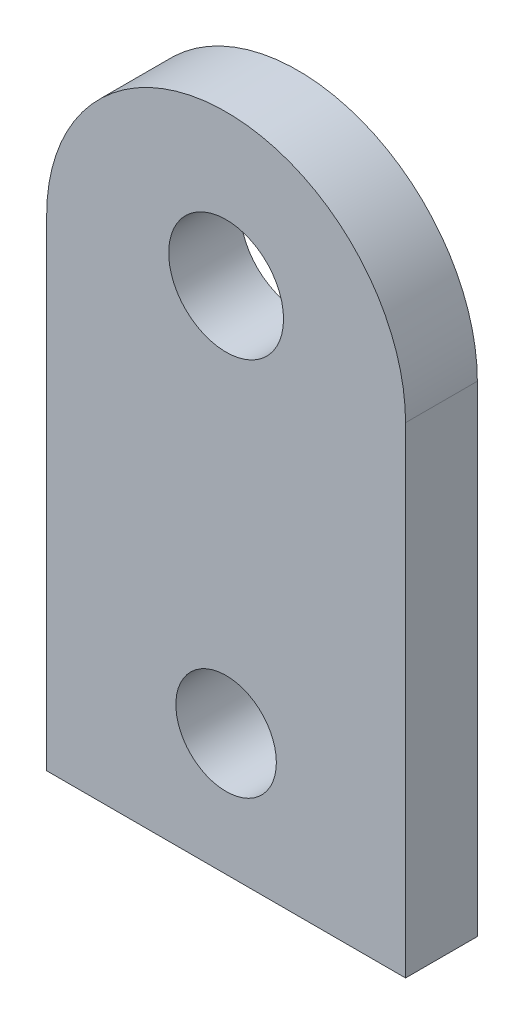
ISO-10303-21;
HEADER;
FILE_DESCRIPTION(('STEP AP214'),'2;1');
FILE_NAME('part.step','',(''),(''),'','','');
FILE_SCHEMA(('AUTOMOTIVE_DESIGN { 1 0 10303 214 1 1 1 1 }'));
ENDSEC;
DATA;
#1=APPLICATION_CONTEXT('core data for automotive mechanical design processes');
#2=APPLICATION_PROTOCOL_DEFINITION('international standard','automotive_design',2000,#1);
#3=PRODUCT_CONTEXT('',#1,'mechanical');
#4=PRODUCT('Part','Part','',(#3));
#5=PRODUCT_RELATED_PRODUCT_CATEGORY('part','',(#4));
#6=PRODUCT_DEFINITION_FORMATION('','',#4);
#7=PRODUCT_DEFINITION_CONTEXT('part definition',#1,'design');
#8=PRODUCT_DEFINITION('design','',#6,#7);
#9=PRODUCT_DEFINITION_SHAPE('','',#8);
#10=(LENGTH_UNIT() NAMED_UNIT(*) SI_UNIT(.MILLI.,.METRE.));
#11=(NAMED_UNIT(*) PLANE_ANGLE_UNIT() SI_UNIT($,.RADIAN.));
#12=(NAMED_UNIT(*) SI_UNIT($,.STERADIAN.) SOLID_ANGLE_UNIT());
#13=UNCERTAINTY_MEASURE_WITH_UNIT(LENGTH_MEASURE(1.E-05),#10,'distance_accuracy_value','');
#14=(GEOMETRIC_REPRESENTATION_CONTEXT(3) GLOBAL_UNCERTAINTY_ASSIGNED_CONTEXT((#13)) GLOBAL_UNIT_ASSIGNED_CONTEXT((#10,
#11,#12)) REPRESENTATION_CONTEXT('',''));
#15=CARTESIAN_POINT('',(0.,0.,0.));
#16=DIRECTION('',(0.,0.,1.));
#17=DIRECTION('',(1.,0.,0.));
#18=AXIS2_PLACEMENT_3D('',#15,#16,#17);
#19=CARTESIAN_POINT('',(-12.5,33.5,5.));
#20=DIRECTION('',(1.,0.,0.));
#21=DIRECTION('',(0.,1.,0.));
#22=AXIS2_PLACEMENT_3D('',#19,#20,#21);
#23=PLANE('',#22);
#24=DIRECTION('',(0.,-1.,0.));
#25=VECTOR('',#24,1.);
#26=CARTESIAN_POINT('',(-12.5,33.5,0.));
#27=LINE('',#26,#25);
#28=CARTESIAN_POINT('',(-12.5,33.5,0.));
#29=VERTEX_POINT('',#28);
#30=CARTESIAN_POINT('',(-12.5,0.,0.));
#31=VERTEX_POINT('',#30);
#32=EDGE_CURVE('E98',#29,#31,#27,.T.);
#33=ORIENTED_EDGE('',*,*,#32,.T.);
#34=DIRECTION('',(0.,0.,-1.));
#35=VECTOR('',#34,1.);
#36=CARTESIAN_POINT('',(-12.5,0.,5.));
#37=LINE('',#36,#35);
#38=CARTESIAN_POINT('',(-12.5,0.,5.));
#39=VERTEX_POINT('',#38);
#40=EDGE_CURVE('E11',#39,#31,#37,.T.);
#41=ORIENTED_EDGE('',*,*,#40,.F.);
#42=DIRECTION('',(0.,-1.,0.));
#43=VECTOR('',#42,1.);
#44=CARTESIAN_POINT('',(-12.5,33.5,5.));
#45=LINE('',#44,#43);
#46=CARTESIAN_POINT('',(-12.5,33.5,5.));
#47=VERTEX_POINT('',#46);
#48=EDGE_CURVE('E86',#47,#39,#45,.T.);
#49=ORIENTED_EDGE('',*,*,#48,.F.);
#50=DIRECTION('',(0.,0.,-1.));
#51=VECTOR('',#50,1.);
#52=CARTESIAN_POINT('',(-12.5,33.5,5.));
#53=LINE('',#52,#51);
#54=EDGE_CURVE('E94',#47,#29,#53,.T.);
#55=ORIENTED_EDGE('',*,*,#54,.T.);
#56=EDGE_LOOP('',(#33,#41,#49,#55));
#57=FACE_BOUND('',#56,.T.);
#58=ADVANCED_FACE('F35',(#57),#23,.F.);
#59=CARTESIAN_POINT('',(-12.5,0.,5.));
#60=DIRECTION('',(0.,1.,0.));
#61=DIRECTION('',(-1.,0.,0.));
#62=AXIS2_PLACEMENT_3D('',#59,#60,#61);
#63=PLANE('',#62);
#64=DIRECTION('',(1.,0.,0.));
#65=VECTOR('',#64,1.);
#66=CARTESIAN_POINT('',(-12.5,0.,0.));
#67=LINE('',#66,#65);
#68=CARTESIAN_POINT('',(12.5,0.,0.));
#69=VERTEX_POINT('',#68);
#70=EDGE_CURVE('E90',#31,#69,#67,.T.);
#71=ORIENTED_EDGE('',*,*,#70,.T.);
#72=DIRECTION('',(0.,0.,-1.));
#73=VECTOR('',#72,1.);
#74=CARTESIAN_POINT('',(12.5,0.,5.));
#75=LINE('',#74,#73);
#76=CARTESIAN_POINT('',(12.5,0.,5.));
#77=VERTEX_POINT('',#76);
#78=EDGE_CURVE('E43',#77,#69,#75,.T.);
#79=ORIENTED_EDGE('',*,*,#78,.F.);
#80=DIRECTION('',(1.,0.,0.));
#81=VECTOR('',#80,1.);
#82=CARTESIAN_POINT('',(-12.5,0.,5.));
#83=LINE('',#82,#81);
#84=EDGE_CURVE('E81',#39,#77,#83,.T.);
#85=ORIENTED_EDGE('',*,*,#84,.F.);
#86=ORIENTED_EDGE('',*,*,#40,.T.);
#87=EDGE_LOOP('',(#71,#79,#85,#86));
#88=FACE_BOUND('',#87,.T.);
#89=ADVANCED_FACE('F89',(#88),#63,.F.);
#90=CARTESIAN_POINT('',(12.5,0.,5.));
#91=DIRECTION('',(-1.,0.,0.));
#92=DIRECTION('',(0.,-1.,0.));
#93=AXIS2_PLACEMENT_3D('',#90,#91,#92);
#94=PLANE('',#93);
#95=DIRECTION('',(0.,1.,0.));
#96=VECTOR('',#95,1.);
#97=CARTESIAN_POINT('',(12.5,0.,0.));
#98=LINE('',#97,#96);
#99=CARTESIAN_POINT('',(12.5,33.5,0.));
#100=VERTEX_POINT('',#99);
#101=EDGE_CURVE('E68',#69,#100,#98,.T.);
#102=ORIENTED_EDGE('',*,*,#101,.T.);
#103=DIRECTION('',(0.,0.,-1.));
#104=VECTOR('',#103,1.);
#105=CARTESIAN_POINT('',(12.5,33.5,5.));
#106=LINE('',#105,#104);
#107=CARTESIAN_POINT('',(12.5,33.5,5.));
#108=VERTEX_POINT('',#107);
#109=EDGE_CURVE('E91',#108,#100,#106,.T.);
#110=ORIENTED_EDGE('',*,*,#109,.F.);
#111=DIRECTION('',(0.,1.,0.));
#112=VECTOR('',#111,1.);
#113=CARTESIAN_POINT('',(12.5,0.,5.));
#114=LINE('',#113,#112);
#115=EDGE_CURVE('E84',#77,#108,#114,.T.);
#116=ORIENTED_EDGE('',*,*,#115,.F.);
#117=ORIENTED_EDGE('',*,*,#78,.T.);
#118=EDGE_LOOP('',(#102,#110,#116,#117));
#119=FACE_BOUND('',#118,.T.);
#120=ADVANCED_FACE('F92',(#119),#94,.F.);
#121=CARTESIAN_POINT('',(0.,33.5,5.));
#122=DIRECTION('',(0.,0.,-1.));
#123=DIRECTION('',(-1.,0.,0.));
#124=AXIS2_PLACEMENT_3D('',#121,#122,#123);
#125=CYLINDRICAL_SURFACE('',#124,12.5);
#126=CARTESIAN_POINT('',(0.,33.5,0.));
#127=DIRECTION('',(0.,0.,1.));
#128=DIRECTION('',(1.,0.,0.));
#129=AXIS2_PLACEMENT_3D('',#126,#127,#128);
#130=CIRCLE('',#129,12.5);
#131=EDGE_CURVE('E74',#100,#29,#130,.T.);
#132=ORIENTED_EDGE('',*,*,#131,.T.);
#133=ORIENTED_EDGE('',*,*,#54,.F.);
#134=CARTESIAN_POINT('',(0.,33.5,5.));
#135=DIRECTION('',(0.,0.,1.));
#136=DIRECTION('',(1.,0.,0.));
#137=AXIS2_PLACEMENT_3D('',#134,#135,#136);
#138=CIRCLE('',#137,12.5);
#139=EDGE_CURVE('E51',#108,#47,#138,.T.);
#140=ORIENTED_EDGE('',*,*,#139,.F.);
#141=ORIENTED_EDGE('',*,*,#109,.T.);
#142=EDGE_LOOP('',(#132,#133,#140,#141));
#143=FACE_BOUND('',#142,.T.);
#144=ADVANCED_FACE('F106',(#143),#125,.T.);
#145=CARTESIAN_POINT('',(0.,33.5,5.));
#146=DIRECTION('',(0.,0.,1.));
#147=DIRECTION('',(1.,0.,0.));
#148=AXIS2_PLACEMENT_3D('',#145,#146,#147);
#149=PLANE('',#148);
#150=CARTESIAN_POINT('',(0.,8.5,5.));
#151=DIRECTION('',(0.,0.,1.));
#152=DIRECTION('',(1.,0.,0.));
#153=AXIS2_PLACEMENT_3D('',#150,#151,#152);
#154=CIRCLE('',#153,3.5);
#155=CARTESIAN_POINT('',(3.5,8.5,5.));
#156=VERTEX_POINT('',#155);
#157=EDGE_CURVE('E118',#156,#156,#154,.T.);
#158=ORIENTED_EDGE('',*,*,#157,.F.);
#159=EDGE_LOOP('',(#158));
#160=FACE_BOUND('',#159,.T.);
#161=CARTESIAN_POINT('',(0.,35.5,5.));
#162=DIRECTION('',(0.,0.,1.));
#163=DIRECTION('',(1.,0.,0.));
#164=AXIS2_PLACEMENT_3D('',#161,#162,#163);
#165=CIRCLE('',#164,3.99999999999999);
#166=CARTESIAN_POINT('',(3.99999999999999,35.5,5.));
#167=VERTEX_POINT('',#166);
#168=EDGE_CURVE('E114',#167,#167,#165,.T.);
#169=ORIENTED_EDGE('',*,*,#168,.F.);
#170=EDGE_LOOP('',(#169));
#171=FACE_BOUND('',#170,.T.);
#172=ORIENTED_EDGE('',*,*,#48,.T.);
#173=ORIENTED_EDGE('',*,*,#84,.T.);
#174=ORIENTED_EDGE('',*,*,#115,.T.);
#175=ORIENTED_EDGE('',*,*,#139,.T.);
#176=EDGE_LOOP('',(#172,#173,#174,#175));
#177=FACE_BOUND('',#176,.T.);
#178=ADVANCED_FACE('F82',(#160,#171,#177),#149,.T.);
#179=CARTESIAN_POINT('',(0.,33.5,0.));
#180=DIRECTION('',(0.,0.,1.));
#181=DIRECTION('',(1.,0.,0.));
#182=AXIS2_PLACEMENT_3D('',#179,#180,#181);
#183=PLANE('',#182);
#184=CARTESIAN_POINT('',(0.,8.5,0.));
#185=DIRECTION('',(0.,0.,1.));
#186=DIRECTION('',(1.,0.,0.));
#187=AXIS2_PLACEMENT_3D('',#184,#185,#186);
#188=CIRCLE('',#187,3.5);
#189=CARTESIAN_POINT('',(3.5,8.5,0.));
#190=VERTEX_POINT('',#189);
#191=EDGE_CURVE('E117',#190,#190,#188,.T.);
#192=ORIENTED_EDGE('',*,*,#191,.T.);
#193=EDGE_LOOP('',(#192));
#194=FACE_BOUND('',#193,.T.);
#195=CARTESIAN_POINT('',(0.,35.5,0.));
#196=DIRECTION('',(0.,0.,1.));
#197=DIRECTION('',(1.,0.,0.));
#198=AXIS2_PLACEMENT_3D('',#195,#196,#197);
#199=CIRCLE('',#198,4.);
#200=CARTESIAN_POINT('',(4.,35.5,0.));
#201=VERTEX_POINT('',#200);
#202=EDGE_CURVE('E101',#201,#201,#199,.T.);
#203=ORIENTED_EDGE('',*,*,#202,.T.);
#204=EDGE_LOOP('',(#203));
#205=FACE_BOUND('',#204,.T.);
#206=ORIENTED_EDGE('',*,*,#32,.F.);
#207=ORIENTED_EDGE('',*,*,#131,.F.);
#208=ORIENTED_EDGE('',*,*,#101,.F.);
#209=ORIENTED_EDGE('',*,*,#70,.F.);
#210=EDGE_LOOP('',(#206,#207,#208,#209));
#211=FACE_BOUND('',#210,.T.);
#212=ADVANCED_FACE('F109',(#194,#205,#211),#183,.F.);
#213=CARTESIAN_POINT('',(0.,35.5,5.));
#214=DIRECTION('',(0.,0.,1.));
#215=DIRECTION('',(1.,0.,0.));
#216=AXIS2_PLACEMENT_3D('',#213,#214,#215);
#217=CYLINDRICAL_SURFACE('',#216,3.99999999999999);
#218=ORIENTED_EDGE('',*,*,#202,.F.);
#219=EDGE_LOOP('',(#218));
#220=FACE_BOUND('',#219,.T.);
#221=ORIENTED_EDGE('',*,*,#168,.T.);
#222=EDGE_LOOP('',(#221));
#223=FACE_BOUND('',#222,.T.);
#224=ADVANCED_FACE('F129',(#220,#223),#217,.F.);
#225=CARTESIAN_POINT('',(0.,8.5,0.));
#226=DIRECTION('',(0.,0.,1.));
#227=DIRECTION('',(1.,0.,0.));
#228=AXIS2_PLACEMENT_3D('',#225,#226,#227);
#229=CYLINDRICAL_SURFACE('',#228,3.5);
#230=ORIENTED_EDGE('',*,*,#191,.F.);
#231=EDGE_LOOP('',(#230));
#232=FACE_BOUND('',#231,.T.);
#233=ORIENTED_EDGE('',*,*,#157,.T.);
#234=EDGE_LOOP('',(#233));
#235=FACE_BOUND('',#234,.T.);
#236=ADVANCED_FACE('F126',(#232,#235),#229,.F.);
#237=CLOSED_SHELL('',(#58,#89,#120,#144,#178,#212,#224,#236));
#238=MANIFOLD_SOLID_BREP('B2',#237);
#239=ADVANCED_BREP_SHAPE_REPRESENTATION('',(#18,#238),#14);
#240=SHAPE_DEFINITION_REPRESENTATION(#9,#239);
ENDSEC;
END-ISO-10303-21;
